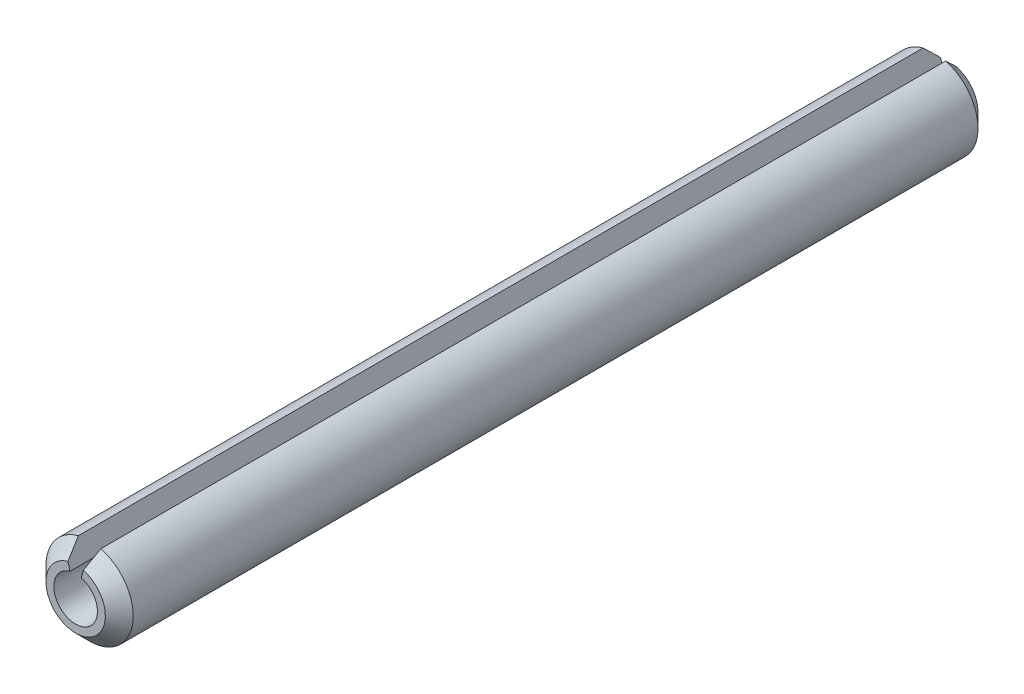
ISO-10303-21;
HEADER;
FILE_DESCRIPTION(('STEP AP214'),'2;1');
FILE_NAME('part.step','',(''),(''),'','','');
FILE_SCHEMA(('AUTOMOTIVE_DESIGN { 1 0 10303 214 1 1 1 1 }'));
ENDSEC;
DATA;
#1=APPLICATION_CONTEXT('core data for automotive mechanical design processes');
#2=APPLICATION_PROTOCOL_DEFINITION('international standard','automotive_design',2000,#1);
#3=PRODUCT_CONTEXT('',#1,'mechanical');
#4=PRODUCT('Part','Part','',(#3));
#5=PRODUCT_RELATED_PRODUCT_CATEGORY('part','',(#4));
#6=PRODUCT_DEFINITION_FORMATION('','',#4);
#7=PRODUCT_DEFINITION_CONTEXT('part definition',#1,'design');
#8=PRODUCT_DEFINITION('design','',#6,#7);
#9=PRODUCT_DEFINITION_SHAPE('','',#8);
#10=(LENGTH_UNIT() NAMED_UNIT(*) SI_UNIT(.MILLI.,.METRE.));
#11=(NAMED_UNIT(*) PLANE_ANGLE_UNIT() SI_UNIT($,.RADIAN.));
#12=(NAMED_UNIT(*) SI_UNIT($,.STERADIAN.) SOLID_ANGLE_UNIT());
#13=UNCERTAINTY_MEASURE_WITH_UNIT(LENGTH_MEASURE(1.E-05),#10,'distance_accuracy_value','');
#14=(GEOMETRIC_REPRESENTATION_CONTEXT(3) GLOBAL_UNCERTAINTY_ASSIGNED_CONTEXT((#13)) GLOBAL_UNIT_ASSIGNED_CONTEXT((#10,
#11,#12)) REPRESENTATION_CONTEXT('',''));
#15=CARTESIAN_POINT('',(0.,0.,0.));
#16=DIRECTION('',(0.,0.,1.));
#17=DIRECTION('',(1.,0.,0.));
#18=AXIS2_PLACEMENT_3D('',#15,#16,#17);
#19=CARTESIAN_POINT('',(0.,0.,15.875));
#20=DIRECTION('',(0.,0.,-1.));
#21=DIRECTION('',(-1.,0.,0.));
#22=AXIS2_PLACEMENT_3D('',#19,#20,#21);
#23=CYLINDRICAL_SURFACE('',#22,0.79375);
#24=CARTESIAN_POINT('',(0.,0.,-15.875));
#25=DIRECTION('',(0.,0.,-1.));
#26=DIRECTION('',(1.,0.,0.));
#27=AXIS2_PLACEMENT_3D('',#24,#25,#26);
#28=CIRCLE('',#27,0.79375);
#29=CARTESIAN_POINT('',(0.205437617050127,0.766703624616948,-15.875));
#30=VERTEX_POINT('',#29);
#31=CARTESIAN_POINT('',(-0.205437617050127,0.766703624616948,-15.875));
#32=VERTEX_POINT('',#31);
#33=EDGE_CURVE('E90',#30,#32,#28,.T.);
#34=ORIENTED_EDGE('',*,*,#33,.T.);
#35=DIRECTION('',(0.,0.,-1.));
#36=VECTOR('',#35,1.);
#37=CARTESIAN_POINT('',(-0.205437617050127,0.766703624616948,15.875));
#38=LINE('',#37,#36);
#39=CARTESIAN_POINT('',(-0.205437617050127,0.766703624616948,15.875));
#40=VERTEX_POINT('',#39);
#41=EDGE_CURVE('E95',#40,#32,#38,.T.);
#42=ORIENTED_EDGE('',*,*,#41,.F.);
#43=CARTESIAN_POINT('',(0.,0.,15.875));
#44=DIRECTION('',(0.,0.,-1.));
#45=DIRECTION('',(1.,0.,0.));
#46=AXIS2_PLACEMENT_3D('',#43,#44,#45);
#47=CIRCLE('',#46,0.79375);
#48=CARTESIAN_POINT('',(0.205437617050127,0.766703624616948,15.875));
#49=VERTEX_POINT('',#48);
#50=EDGE_CURVE('E110',#49,#40,#47,.T.);
#51=ORIENTED_EDGE('',*,*,#50,.F.);
#52=DIRECTION('',(0.,0.,-1.));
#53=VECTOR('',#52,1.);
#54=CARTESIAN_POINT('',(0.205437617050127,0.766703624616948,15.875));
#55=LINE('',#54,#53);
#56=EDGE_CURVE('E106',#49,#30,#55,.T.);
#57=ORIENTED_EDGE('',*,*,#56,.T.);
#58=EDGE_LOOP('',(#34,#42,#51,#57));
#59=FACE_BOUND('',#58,.T.);
#60=ADVANCED_FACE('F34',(#59),#23,.F.);
#61=CARTESIAN_POINT('',(-0.205437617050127,0.766703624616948,15.875));
#62=DIRECTION('',(-0.965925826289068,-0.258819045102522,0.));
#63=DIRECTION('',(0.258819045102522,-0.965925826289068,0.));
#64=AXIS2_PLACEMENT_3D('',#61,#62,#63);
#65=PLANE('',#64);
#66=DIRECTION('',(-0.258819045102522,0.965925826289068,0.));
#67=VECTOR('',#66,1.);
#68=CARTESIAN_POINT('',(-0.205437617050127,0.766703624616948,-15.875));
#69=LINE('',#68,#67);
#70=CARTESIAN_POINT('',(-0.27939515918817,1.04271692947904,-15.875));
#71=VERTEX_POINT('',#70);
#72=EDGE_CURVE('E86',#32,#71,#69,.T.);
#73=ORIENTED_EDGE('',*,*,#72,.T.);
#74=DIRECTION('',(0.183012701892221,-0.683012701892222,-0.707106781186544));
#75=VECTOR('',#74,1.);
#76=CARTESIAN_POINT('',(0.,0.,-16.9545));
#77=LINE('',#76,#75);
#78=CARTESIAN_POINT('',(-0.410875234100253,1.53340724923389,-15.367));
#79=VERTEX_POINT('',#78);
#80=EDGE_CURVE('E41',#71,#79,#77,.F.);
#81=ORIENTED_EDGE('',*,*,#80,.T.);
#82=DIRECTION('',(0.,0.,-1.));
#83=VECTOR('',#82,1.);
#84=CARTESIAN_POINT('',(-0.410875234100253,1.5334072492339,15.875));
#85=LINE('',#84,#83);
#86=CARTESIAN_POINT('',(-0.410875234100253,1.5334072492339,15.367));
#87=VERTEX_POINT('',#86);
#88=EDGE_CURVE('E102',#87,#79,#85,.T.);
#89=ORIENTED_EDGE('',*,*,#88,.F.);
#90=DIRECTION('',(-0.183012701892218,0.683012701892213,-0.707106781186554));
#91=VECTOR('',#90,1.);
#92=CARTESIAN_POINT('',(0.,0.,16.9545));
#93=LINE('',#92,#91);
#94=CARTESIAN_POINT('',(-0.279395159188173,1.04271692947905,15.875));
#95=VERTEX_POINT('',#94);
#96=EDGE_CURVE('E48',#87,#95,#93,.F.);
#97=ORIENTED_EDGE('',*,*,#96,.T.);
#98=DIRECTION('',(-0.258819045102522,0.965925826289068,0.));
#99=VECTOR('',#98,1.);
#100=CARTESIAN_POINT('',(-0.205437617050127,0.766703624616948,15.875));
#101=LINE('',#100,#99);
#102=EDGE_CURVE('E97',#40,#95,#101,.T.);
#103=ORIENTED_EDGE('',*,*,#102,.F.);
#104=ORIENTED_EDGE('',*,*,#41,.T.);
#105=EDGE_LOOP('',(#73,#81,#89,#97,#103,#104));
#106=FACE_BOUND('',#105,.T.);
#107=ADVANCED_FACE('F96',(#106),#65,.F.);
#108=CARTESIAN_POINT('',(0.,0.,15.875));
#109=DIRECTION('',(0.,0.,-1.));
#110=DIRECTION('',(-1.,0.,0.));
#111=AXIS2_PLACEMENT_3D('',#108,#109,#110);
#112=CYLINDRICAL_SURFACE('',#111,1.5875);
#113=ORIENTED_EDGE('',*,*,#88,.T.);
#114=CARTESIAN_POINT('',(0.,0.,-15.367));
#115=DIRECTION('',(0.,0.,1.));
#116=DIRECTION('',(1.,0.,0.));
#117=AXIS2_PLACEMENT_3D('',#114,#115,#116);
#118=CIRCLE('',#117,1.5875);
#119=CARTESIAN_POINT('',(0.410875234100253,1.53340724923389,-15.367));
#120=VERTEX_POINT('',#119);
#121=EDGE_CURVE('E122',#79,#120,#118,.T.);
#122=ORIENTED_EDGE('',*,*,#121,.T.);
#123=DIRECTION('',(0.,0.,-1.));
#124=VECTOR('',#123,1.);
#125=CARTESIAN_POINT('',(0.410875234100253,1.5334072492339,15.875));
#126=LINE('',#125,#124);
#127=CARTESIAN_POINT('',(0.410875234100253,1.5334072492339,15.367));
#128=VERTEX_POINT('',#127);
#129=EDGE_CURVE('E116',#128,#120,#126,.T.);
#130=ORIENTED_EDGE('',*,*,#129,.F.);
#131=CARTESIAN_POINT('',(0.,0.,15.367));
#132=DIRECTION('',(0.,0.,1.));
#133=DIRECTION('',(1.,0.,0.));
#134=AXIS2_PLACEMENT_3D('',#131,#132,#133);
#135=CIRCLE('',#134,1.5875);
#136=EDGE_CURVE('E101',#128,#87,#135,.F.);
#137=ORIENTED_EDGE('',*,*,#136,.T.);
#138=EDGE_LOOP('',(#113,#122,#130,#137));
#139=FACE_BOUND('',#138,.T.);
#140=ADVANCED_FACE('F133',(#139),#112,.T.);
#141=CARTESIAN_POINT('',(0.205437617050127,0.766703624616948,15.875));
#142=DIRECTION('',(0.965925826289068,-0.258819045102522,0.));
#143=DIRECTION('',(0.258819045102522,0.965925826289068,0.));
#144=AXIS2_PLACEMENT_3D('',#141,#142,#143);
#145=PLANE('',#144);
#146=ORIENTED_EDGE('',*,*,#129,.T.);
#147=DIRECTION('',(0.183012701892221,0.683012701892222,0.707106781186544));
#148=VECTOR('',#147,1.);
#149=CARTESIAN_POINT('',(0.,0.,-16.9545));
#150=LINE('',#149,#148);
#151=CARTESIAN_POINT('',(0.27939515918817,1.04271692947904,-15.875));
#152=VERTEX_POINT('',#151);
#153=EDGE_CURVE('E127',#120,#152,#150,.F.);
#154=ORIENTED_EDGE('',*,*,#153,.T.);
#155=DIRECTION('',(-0.258819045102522,-0.965925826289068,0.));
#156=VECTOR('',#155,1.);
#157=CARTESIAN_POINT('',(0.205437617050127,0.766703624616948,-15.875));
#158=LINE('',#157,#156);
#159=EDGE_CURVE('E92',#152,#30,#158,.T.);
#160=ORIENTED_EDGE('',*,*,#159,.T.);
#161=ORIENTED_EDGE('',*,*,#56,.F.);
#162=DIRECTION('',(-0.258819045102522,-0.965925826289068,0.));
#163=VECTOR('',#162,1.);
#164=CARTESIAN_POINT('',(0.205437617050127,0.766703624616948,15.875));
#165=LINE('',#164,#163);
#166=CARTESIAN_POINT('',(0.279395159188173,1.04271692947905,15.875));
#167=VERTEX_POINT('',#166);
#168=EDGE_CURVE('E113',#167,#49,#165,.T.);
#169=ORIENTED_EDGE('',*,*,#168,.F.);
#170=DIRECTION('',(-0.183012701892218,-0.683012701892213,0.707106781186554));
#171=VECTOR('',#170,1.);
#172=CARTESIAN_POINT('',(0.,0.,16.9545));
#173=LINE('',#172,#171);
#174=EDGE_CURVE('E125',#167,#128,#173,.F.);
#175=ORIENTED_EDGE('',*,*,#174,.T.);
#176=EDGE_LOOP('',(#146,#154,#160,#161,#169,#175));
#177=FACE_BOUND('',#176,.T.);
#178=ADVANCED_FACE('F138',(#177),#145,.F.);
#179=CARTESIAN_POINT('',(0.,0.,15.875));
#180=DIRECTION('',(0.,0.,1.));
#181=DIRECTION('',(1.,0.,0.));
#182=AXIS2_PLACEMENT_3D('',#179,#180,#181);
#183=PLANE('',#182);
#184=ORIENTED_EDGE('',*,*,#102,.T.);
#185=CARTESIAN_POINT('',(0.,0.,15.875));
#186=DIRECTION('',(0.,0.,1.));
#187=DIRECTION('',(1.,0.,0.));
#188=AXIS2_PLACEMENT_3D('',#185,#186,#187);
#189=CIRCLE('',#188,1.07950000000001);
#190=EDGE_CURVE('E11',#95,#167,#189,.T.);
#191=ORIENTED_EDGE('',*,*,#190,.T.);
#192=ORIENTED_EDGE('',*,*,#168,.T.);
#193=ORIENTED_EDGE('',*,*,#50,.T.);
#194=EDGE_LOOP('',(#184,#191,#192,#193));
#195=FACE_BOUND('',#194,.T.);
#196=ADVANCED_FACE('F144',(#195),#183,.T.);
#197=CARTESIAN_POINT('',(0.,0.,-15.875));
#198=DIRECTION('',(0.,0.,1.));
#199=DIRECTION('',(1.,0.,0.));
#200=AXIS2_PLACEMENT_3D('',#197,#198,#199);
#201=PLANE('',#200);
#202=ORIENTED_EDGE('',*,*,#159,.F.);
#203=CARTESIAN_POINT('',(0.,0.,-15.875));
#204=DIRECTION('',(0.,0.,1.));
#205=DIRECTION('',(1.,0.,0.));
#206=AXIS2_PLACEMENT_3D('',#203,#204,#205);
#207=CIRCLE('',#206,1.07949999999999);
#208=EDGE_CURVE('E56',#152,#71,#207,.F.);
#209=ORIENTED_EDGE('',*,*,#208,.T.);
#210=ORIENTED_EDGE('',*,*,#72,.F.);
#211=ORIENTED_EDGE('',*,*,#33,.F.);
#212=EDGE_LOOP('',(#202,#209,#210,#211));
#213=FACE_BOUND('',#212,.T.);
#214=ADVANCED_FACE('F88',(#213),#201,.F.);
#215=CARTESIAN_POINT('',(0.,0.,-15.367));
#216=DIRECTION('',(0.,0.,1.));
#217=DIRECTION('',(1.,0.,0.));
#218=AXIS2_PLACEMENT_3D('',#215,#216,#217);
#219=CONICAL_SURFACE('',#218,1.5875,0.785398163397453);
#220=ORIENTED_EDGE('',*,*,#80,.F.);
#221=ORIENTED_EDGE('',*,*,#208,.F.);
#222=ORIENTED_EDGE('',*,*,#153,.F.);
#223=ORIENTED_EDGE('',*,*,#121,.F.);
#224=EDGE_LOOP('',(#220,#221,#222,#223));
#225=FACE_BOUND('',#224,.T.);
#226=ADVANCED_FACE('F136',(#225),#219,.T.);
#227=CARTESIAN_POINT('',(0.,0.,15.875));
#228=DIRECTION('',(0.,0.,-1.));
#229=DIRECTION('',(-1.,0.,0.));
#230=AXIS2_PLACEMENT_3D('',#227,#228,#229);
#231=CONICAL_SURFACE('',#230,1.07950000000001,0.78539816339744);
#232=ORIENTED_EDGE('',*,*,#96,.F.);
#233=ORIENTED_EDGE('',*,*,#136,.F.);
#234=ORIENTED_EDGE('',*,*,#174,.F.);
#235=ORIENTED_EDGE('',*,*,#190,.F.);
#236=EDGE_LOOP('',(#232,#233,#234,#235));
#237=FACE_BOUND('',#236,.T.);
#238=ADVANCED_FACE('F141',(#237),#231,.T.);
#239=CLOSED_SHELL('',(#60,#107,#140,#178,#196,#214,#226,#238));
#240=MANIFOLD_SOLID_BREP('B2',#239);
#241=ADVANCED_BREP_SHAPE_REPRESENTATION('',(#18,#240),#14);
#242=SHAPE_DEFINITION_REPRESENTATION(#9,#241);
ENDSEC;
END-ISO-10303-21;
